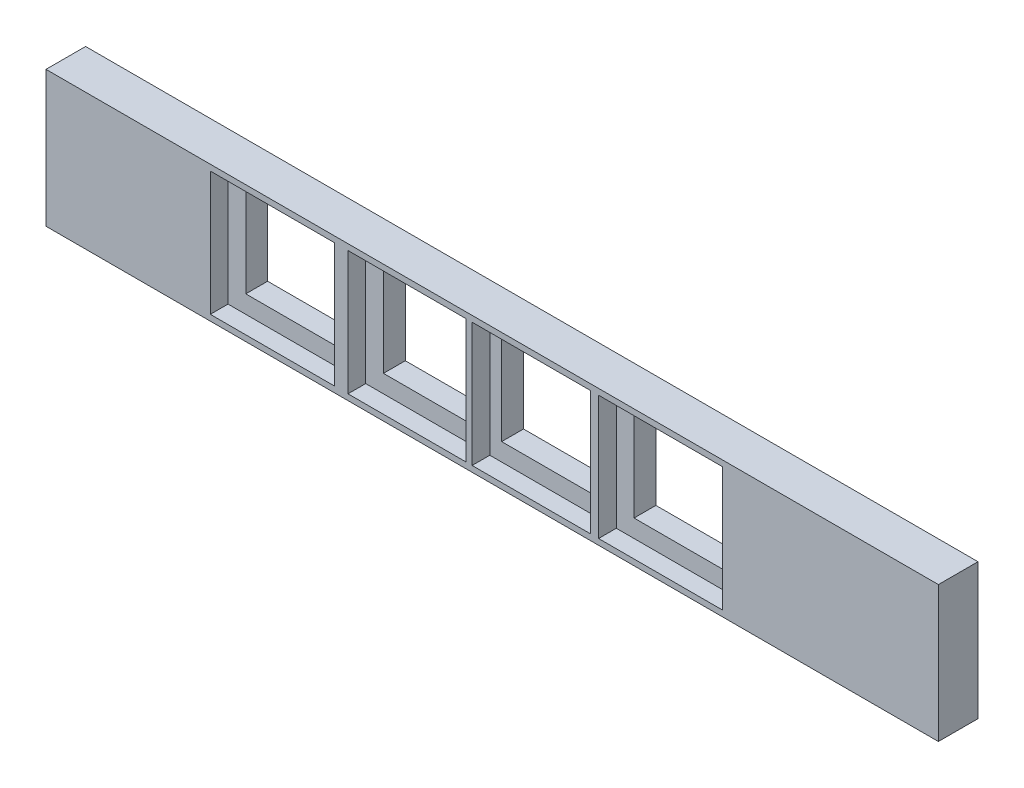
from build123d import *

# Parameters (mm, degrees)
SKETCH1_W           = 151
SKETCH1_H           = 23
BOSS_EXTRUDE1_DEPTH = 6.7
SKETCH2_W           = 15
SKETCH2_H           = 15
CUT_EXTRUDE1_DEPTH  = 6.7
SKETCH3_W           = 21
SKETCH3_H           = 21
SKETCH3_W_2         = 20
CUT_EXTRUDE2_DEPTH  = 3


with BuildPart() as part:
    # Sketch1 → Boss-Extrude1 (new body)
    with BuildSketch(Plane.XY):
        with Locations((75.5, 11.5)):
            Rectangle(SKETCH1_W, SKETCH1_H)
    extrude(amount=BOSS_EXTRUDE1_DEPTH)

    # Sketch2 → Cut-Extrude1 (cut)
    with BuildSketch(Plane.XY.offset(6.7)):
        with Locations((104, 11.5)):
            Rectangle(SKETCH2_W, SKETCH2_H)
        with Locations((81.6, 11.5)):
            Rectangle(SKETCH2_W, SKETCH2_H)
        with Locations((61.6, 11.5)):
            Rectangle(SKETCH2_W, SKETCH2_H)
        with Locations((38.3, 11.5)):
            Rectangle(SKETCH2_W, SKETCH2_H)
    extrude(amount=-CUT_EXTRUDE1_DEPTH, mode=Mode.SUBTRACT)

    # Sketch3 → Cut-Extrude2 (cut)
    with BuildSketch(Plane.XY.offset(6.7)):
        with Locations((38.3, 11.5)):
            Rectangle(SKETCH3_W, SKETCH3_H)
        with Locations((61.1, 11.5)):
            Rectangle(SKETCH3_W_2, SKETCH3_H)
        with Locations((82.1, 11.5)):
            Rectangle(SKETCH3_W_2, SKETCH3_H)
        with Locations((104, 11.5)):
            Rectangle(SKETCH3_W, SKETCH3_H)
    extrude(amount=-CUT_EXTRUDE2_DEPTH, mode=Mode.SUBTRACT)


solid = part.part
